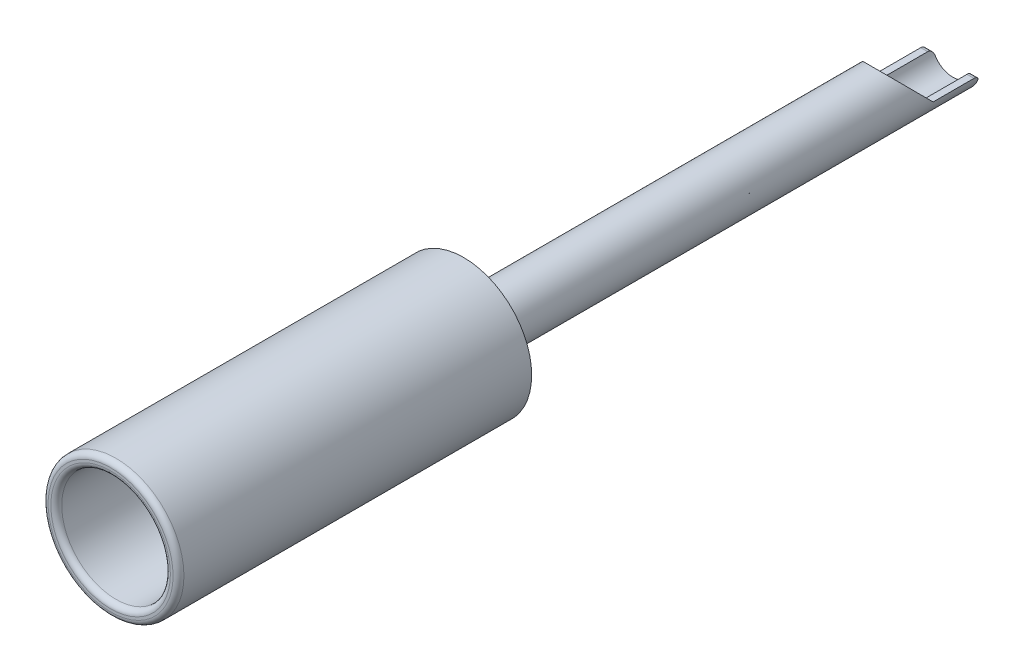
from build123d import *

# Parameters (mm, degrees)
ESQUISSE1_R             = 2.5
BOSS_EXTRU_1_DEPTH      = 31
ESQUISSE2_R             = 2
ENL_V_MAT_EXTRU_1_DEPTH = 12
ESQUISSE3_OUTSIDE_W     = 13.36
ESQUISSE3_OUTSIDE_H     = 13.36
ESQUISSE3_OUTSIDE_R     = 1
ENL_V_MAT_EXTRU_2_DEPTH = 18
ESQUISSE4_R             = 0.5
ENL_V_MAT_EXTRU_5_DEPTH = 32.200961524
ESQUISSE5_R             = 0.75
ENL_V_MAT_EXTRU_6_DEPTH = 3
CONG_1_R                = 0.2
ENL_V_MAT_EXTRU_7_DEPTH = 1.5
CONG_2_R                = 0.2


with BuildPart() as part:
    # Esquisse1 → Boss.-Extru.1 (new body)
    with BuildSketch(Plane.XY):
        Circle(ESQUISSE1_R)
    extrude(amount=-BOSS_EXTRU_1_DEPTH)

    # Esquisse2 → Enl_v. mat.-Extru.1 (cut)
    with BuildSketch(Plane.XY):
        Circle(ESQUISSE2_R)
    extrude(amount=-ENL_V_MAT_EXTRU_1_DEPTH, mode=Mode.SUBTRACT)

    # Esquisse3 outside → Enl_v. mat.-Extru.2 (cut)
    with BuildSketch(Plane(origin=(0, 0, -31), x_dir=(-1, 0, 0), z_dir=(0, 0, -1))):
        Rectangle(ESQUISSE3_OUTSIDE_W, ESQUISSE3_OUTSIDE_H)
        Circle(ESQUISSE3_OUTSIDE_R, mode=Mode.SUBTRACT)
    extrude(amount=-ENL_V_MAT_EXTRU_2_DEPTH, mode=Mode.SUBTRACT)

    # Esquisse4 → Enl_v. mat.-Extru.5 (cut, through all)
    with BuildSketch(Plane(origin=(0, 0, -31), x_dir=(-1, 0, 0), z_dir=(0, 0, -1))):
        Circle(ESQUISSE4_R)
    extrude(amount=-ENL_V_MAT_EXTRU_5_DEPTH, mode=Mode.SUBTRACT)

    # Esquisse5 → Enl_v. mat.-Extru.6 (cut)
    with BuildSketch(Plane(origin=(0, 0, -31), x_dir=(-1, 0, 0), z_dir=(0, 0, -1))):
        Circle(ESQUISSE5_R)
    extrude(amount=-ENL_V_MAT_EXTRU_6_DEPTH, mode=Mode.SUBTRACT)

    # Cong_1
    cong_1_edges = [part.edges().sort_by_distance(p)[0] for p in [
        (-2.5, 0, 0),
        (-2, 0, 0),
    ]]
    fillet(cong_1_edges, radius=CONG_1_R)

    # Esquisse6 → Enl_v. mat.-Extru.7 (cut, symmetric)
    with BuildSketch(Plane(origin=(0, 0, 0), x_dir=(0, 0, -1), z_dir=(1, 0, 0))):
        Polygon((27.3, 1.8), (29.3, -0.2), (31.5, -0.2), (31.5, 1.8), align=None)
    extrude(amount=ENL_V_MAT_EXTRU_7_DEPTH, both=True, mode=Mode.SUBTRACT)

    # Cong_2
    cong_2_edges = [part.edges().sort_by_distance(p)[0] for p in [
        (-0.851318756, -0.2, -31),
        (0.851318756, -0.2, -31),
    ]]
    fillet(cong_2_edges, radius=CONG_2_R)


solid = part.part
